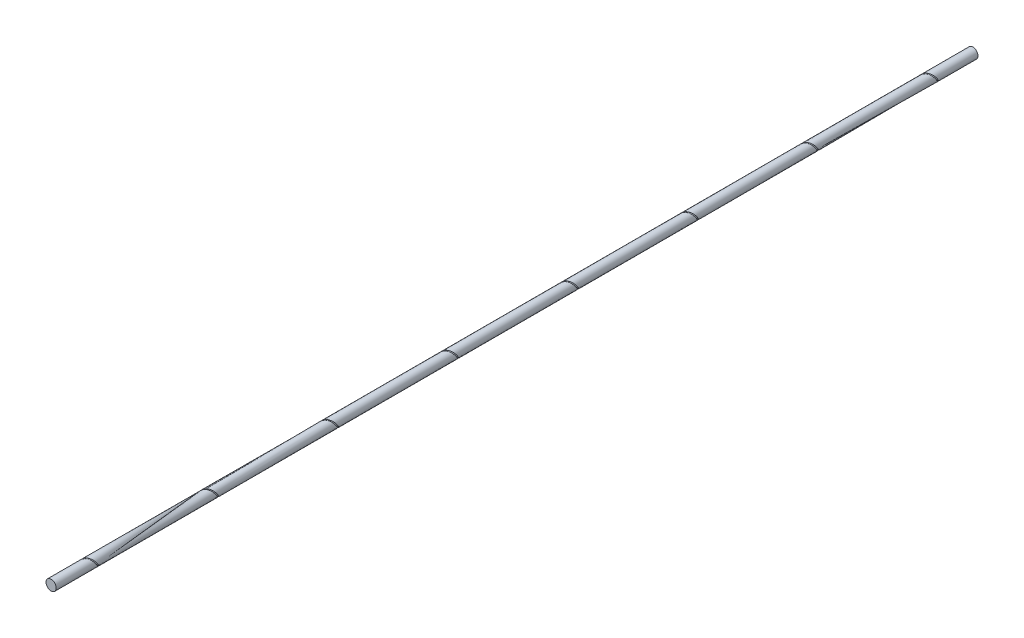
from build123d import *

# Parameters (mm, degrees)
SKETCH1_R              = 25
BOSS_EXTRUDE1_DEPTH    = 4500
CUT_SWEEP1_PITCH       = 100
CUT_SWEEP1_HEIGHT      = 100
CUT_SWEEP1_RADIUS      = 27.646
CUT_SWEEP1_START_ANGLE = -180
SKETCH3_R              = 3.969
LPATTERN1_COUNT        = 8
LPATTERN1_PITCH        = 585.714285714


with BuildPart() as part:
    # Sketch1 → Boss-Extrude1 (new body)
    with BuildSketch(Plane.XY):
        Circle(SKETCH1_R)
    extrude(amount=BOSS_EXTRUDE1_DEPTH)

    # Cut-Sweep1: sweep along a helix
    with BuildLine() as cut_sweep1_path:
        add(Helix(CUT_SWEEP1_PITCH, CUT_SWEEP1_HEIGHT, CUT_SWEEP1_RADIUS, center=(0, 0, 150), direction=(0, 0, 1), mode=Mode.PRIVATE).rotate(Axis((0, 0, 150), (0, 0, 1)), CUT_SWEEP1_START_ANGLE))
    # Sketch3 → Cut-Sweep1 (sweep, cut)
    with BuildSketch(Plane(origin=(0, 0, 0), x_dir=(1, 0, 0), z_dir=(0, 1, 0))):
        with Locations((-27.646, -150)):
            Circle(SKETCH3_R)
    cut_sweep1 = sweep(path=cut_sweep1_path.line, is_frenet=True, mode=Mode.SUBTRACT)

    # LPattern1: Cut-Sweep1 ×8
    with Locations(*[(0, 0, i * LPATTERN1_PITCH) for i in range(1, LPATTERN1_COUNT)]):
        add(cut_sweep1, mode=Mode.SUBTRACT)


solid = part.part
